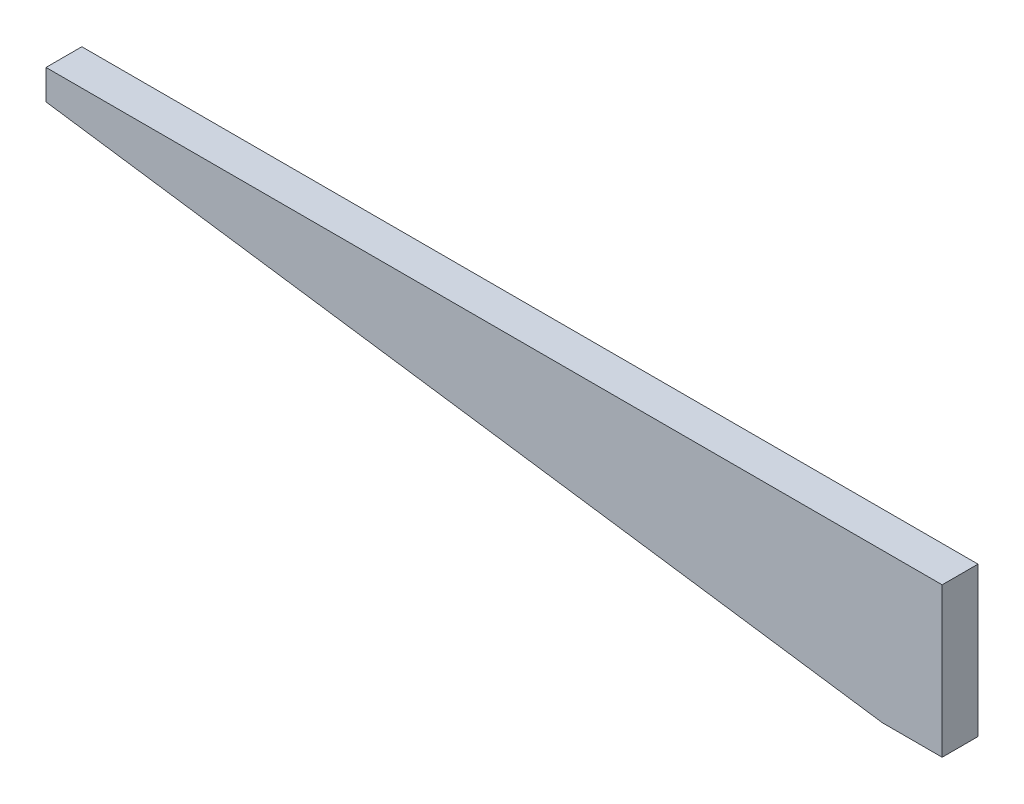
ISO-10303-21;
HEADER;
FILE_DESCRIPTION(('STEP AP214'),'2;1');
FILE_NAME('part.step','',(''),(''),'','','');
FILE_SCHEMA(('AUTOMOTIVE_DESIGN { 1 0 10303 214 1 1 1 1 }'));
ENDSEC;
DATA;
#1=APPLICATION_CONTEXT('core data for automotive mechanical design processes');
#2=APPLICATION_PROTOCOL_DEFINITION('international standard','automotive_design',2000,#1);
#3=PRODUCT_CONTEXT('',#1,'mechanical');
#4=PRODUCT('Part','Part','',(#3));
#5=PRODUCT_RELATED_PRODUCT_CATEGORY('part','',(#4));
#6=PRODUCT_DEFINITION_FORMATION('','',#4);
#7=PRODUCT_DEFINITION_CONTEXT('part definition',#1,'design');
#8=PRODUCT_DEFINITION('design','',#6,#7);
#9=PRODUCT_DEFINITION_SHAPE('','',#8);
#10=(LENGTH_UNIT() NAMED_UNIT(*) SI_UNIT(.MILLI.,.METRE.));
#11=(NAMED_UNIT(*) PLANE_ANGLE_UNIT() SI_UNIT($,.RADIAN.));
#12=(NAMED_UNIT(*) SI_UNIT($,.STERADIAN.) SOLID_ANGLE_UNIT());
#13=UNCERTAINTY_MEASURE_WITH_UNIT(LENGTH_MEASURE(1.E-05),#10,'distance_accuracy_value','');
#14=(GEOMETRIC_REPRESENTATION_CONTEXT(3) GLOBAL_UNCERTAINTY_ASSIGNED_CONTEXT((#13)) GLOBAL_UNIT_ASSIGNED_CONTEXT((#10,
#11,#12)) REPRESENTATION_CONTEXT('',''));
#15=CARTESIAN_POINT('',(0.,0.,0.));
#16=DIRECTION('',(0.,0.,1.));
#17=DIRECTION('',(1.,0.,0.));
#18=AXIS2_PLACEMENT_3D('',#15,#16,#17);
#19=CARTESIAN_POINT('',(-10.,0.,3.));
#20=DIRECTION('',(0.,1.,0.));
#21=DIRECTION('',(0.,0.,1.));
#22=AXIS2_PLACEMENT_3D('',#19,#20,#21);
#23=PLANE('',#22);
#24=DIRECTION('',(1.,0.,0.));
#25=VECTOR('',#24,1.);
#26=CARTESIAN_POINT('',(-10.,0.,-3.));
#27=LINE('',#26,#25);
#28=CARTESIAN_POINT('',(-10.,0.,-3.));
#29=VERTEX_POINT('',#28);
#30=CARTESIAN_POINT('',(0.,0.,-3.));
#31=VERTEX_POINT('',#30);
#32=EDGE_CURVE('E81',#29,#31,#27,.T.);
#33=ORIENTED_EDGE('',*,*,#32,.T.);
#34=DIRECTION('',(0.,0.,-1.));
#35=VECTOR('',#34,1.);
#36=CARTESIAN_POINT('',(0.,0.,3.));
#37=LINE('',#36,#35);
#38=CARTESIAN_POINT('',(0.,0.,3.));
#39=VERTEX_POINT('',#38);
#40=EDGE_CURVE('E11',#39,#31,#37,.T.);
#41=ORIENTED_EDGE('',*,*,#40,.F.);
#42=DIRECTION('',(1.,0.,0.));
#43=VECTOR('',#42,1.);
#44=CARTESIAN_POINT('',(-10.,0.,3.));
#45=LINE('',#44,#43);
#46=CARTESIAN_POINT('',(-10.,0.,3.));
#47=VERTEX_POINT('',#46);
#48=EDGE_CURVE('E102',#47,#39,#45,.T.);
#49=ORIENTED_EDGE('',*,*,#48,.F.);
#50=DIRECTION('',(0.,0.,-1.));
#51=VECTOR('',#50,1.);
#52=CARTESIAN_POINT('',(-10.,0.,3.));
#53=LINE('',#52,#51);
#54=EDGE_CURVE('E94',#47,#29,#53,.T.);
#55=ORIENTED_EDGE('',*,*,#54,.T.);
#56=EDGE_LOOP('',(#33,#41,#49,#55));
#57=FACE_BOUND('',#56,.T.);
#58=ADVANCED_FACE('F31',(#57),#23,.F.);
#59=CARTESIAN_POINT('',(0.,0.,3.));
#60=DIRECTION('',(-1.,0.,0.));
#61=DIRECTION('',(0.,0.,1.));
#62=AXIS2_PLACEMENT_3D('',#59,#60,#61);
#63=PLANE('',#62);
#64=DIRECTION('',(0.,1.,0.));
#65=VECTOR('',#64,1.);
#66=CARTESIAN_POINT('',(0.,0.,-3.));
#67=LINE('',#66,#65);
#68=CARTESIAN_POINT('',(0.,25.,-3.));
#69=VERTEX_POINT('',#68);
#70=EDGE_CURVE('E77',#31,#69,#67,.T.);
#71=ORIENTED_EDGE('',*,*,#70,.T.);
#72=DIRECTION('',(0.,0.,-1.));
#73=VECTOR('',#72,1.);
#74=CARTESIAN_POINT('',(0.,25.,3.));
#75=LINE('',#74,#73);
#76=CARTESIAN_POINT('',(0.,25.,3.));
#77=VERTEX_POINT('',#76);
#78=EDGE_CURVE('E38',#77,#69,#75,.T.);
#79=ORIENTED_EDGE('',*,*,#78,.F.);
#80=DIRECTION('',(0.,1.,0.));
#81=VECTOR('',#80,1.);
#82=CARTESIAN_POINT('',(0.,0.,3.));
#83=LINE('',#82,#81);
#84=EDGE_CURVE('E90',#39,#77,#83,.T.);
#85=ORIENTED_EDGE('',*,*,#84,.F.);
#86=ORIENTED_EDGE('',*,*,#40,.T.);
#87=EDGE_LOOP('',(#71,#79,#85,#86));
#88=FACE_BOUND('',#87,.T.);
#89=ADVANCED_FACE('F89',(#88),#63,.F.);
#90=CARTESIAN_POINT('',(0.,25.,3.));
#91=DIRECTION('',(0.,-1.,0.));
#92=DIRECTION('',(1.,0.,0.));
#93=AXIS2_PLACEMENT_3D('',#90,#91,#92);
#94=PLANE('',#93);
#95=DIRECTION('',(-1.,0.,0.));
#96=VECTOR('',#95,1.);
#97=CARTESIAN_POINT('',(0.,25.,-3.));
#98=LINE('',#97,#96);
#99=CARTESIAN_POINT('',(-150.,25.,-3.));
#100=VERTEX_POINT('',#99);
#101=EDGE_CURVE('E83',#69,#100,#98,.T.);
#102=ORIENTED_EDGE('',*,*,#101,.T.);
#103=DIRECTION('',(0.,0.,-1.));
#104=VECTOR('',#103,1.);
#105=CARTESIAN_POINT('',(-150.,25.,3.));
#106=LINE('',#105,#104);
#107=CARTESIAN_POINT('',(-150.,25.,3.));
#108=VERTEX_POINT('',#107);
#109=EDGE_CURVE('E113',#108,#100,#106,.T.);
#110=ORIENTED_EDGE('',*,*,#109,.F.);
#111=DIRECTION('',(-1.,0.,0.));
#112=VECTOR('',#111,1.);
#113=CARTESIAN_POINT('',(0.,25.,3.));
#114=LINE('',#113,#112);
#115=EDGE_CURVE('E105',#77,#108,#114,.T.);
#116=ORIENTED_EDGE('',*,*,#115,.F.);
#117=ORIENTED_EDGE('',*,*,#78,.T.);
#118=EDGE_LOOP('',(#102,#110,#116,#117));
#119=FACE_BOUND('',#118,.T.);
#120=ADVANCED_FACE('F117',(#119),#94,.F.);
#121=CARTESIAN_POINT('',(-150.,25.,3.));
#122=DIRECTION('',(1.,0.,0.));
#123=DIRECTION('',(0.,0.,-1.));
#124=AXIS2_PLACEMENT_3D('',#121,#122,#123);
#125=PLANE('',#124);
#126=DIRECTION('',(0.,-1.,0.));
#127=VECTOR('',#126,1.);
#128=CARTESIAN_POINT('',(-150.,25.,-3.));
#129=LINE('',#128,#127);
#130=CARTESIAN_POINT('',(-150.,20.,-3.));
#131=VERTEX_POINT('',#130);
#132=EDGE_CURVE('E98',#100,#131,#129,.T.);
#133=ORIENTED_EDGE('',*,*,#132,.T.);
#134=DIRECTION('',(0.,0.,-1.));
#135=VECTOR('',#134,1.);
#136=CARTESIAN_POINT('',(-150.,20.,3.));
#137=LINE('',#136,#135);
#138=CARTESIAN_POINT('',(-150.,20.,3.));
#139=VERTEX_POINT('',#138);
#140=EDGE_CURVE('E110',#139,#131,#137,.T.);
#141=ORIENTED_EDGE('',*,*,#140,.F.);
#142=DIRECTION('',(0.,-1.,0.));
#143=VECTOR('',#142,1.);
#144=CARTESIAN_POINT('',(-150.,25.,3.));
#145=LINE('',#144,#143);
#146=EDGE_CURVE('E50',#108,#139,#145,.T.);
#147=ORIENTED_EDGE('',*,*,#146,.F.);
#148=ORIENTED_EDGE('',*,*,#109,.T.);
#149=EDGE_LOOP('',(#133,#141,#147,#148));
#150=FACE_BOUND('',#149,.T.);
#151=ADVANCED_FACE('F128',(#150),#125,.F.);
#152=CARTESIAN_POINT('',(-150.,20.,3.));
#153=DIRECTION('',(0.141421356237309,0.989949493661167,0.));
#154=DIRECTION('',(-0.989949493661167,0.141421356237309,0.));
#155=AXIS2_PLACEMENT_3D('',#152,#153,#154);
#156=PLANE('',#155);
#157=DIRECTION('',(0.989949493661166,-0.141421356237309,0.));
#158=VECTOR('',#157,1.);
#159=CARTESIAN_POINT('',(-150.,20.,-3.));
#160=LINE('',#159,#158);
#161=EDGE_CURVE('E100',#131,#29,#160,.T.);
#162=ORIENTED_EDGE('',*,*,#161,.T.);
#163=ORIENTED_EDGE('',*,*,#54,.F.);
#164=DIRECTION('',(0.989949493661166,-0.141421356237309,0.));
#165=VECTOR('',#164,1.);
#166=CARTESIAN_POINT('',(-150.,20.,3.));
#167=LINE('',#166,#165);
#168=EDGE_CURVE('E45',#139,#47,#167,.T.);
#169=ORIENTED_EDGE('',*,*,#168,.F.);
#170=ORIENTED_EDGE('',*,*,#140,.T.);
#171=EDGE_LOOP('',(#162,#163,#169,#170));
#172=FACE_BOUND('',#171,.T.);
#173=ADVANCED_FACE('F121',(#172),#156,.F.);
#174=CARTESIAN_POINT('',(0.,0.,3.));
#175=DIRECTION('',(0.,0.,1.));
#176=DIRECTION('',(1.,0.,0.));
#177=AXIS2_PLACEMENT_3D('',#174,#175,#176);
#178=PLANE('',#177);
#179=ORIENTED_EDGE('',*,*,#48,.T.);
#180=ORIENTED_EDGE('',*,*,#84,.T.);
#181=ORIENTED_EDGE('',*,*,#115,.T.);
#182=ORIENTED_EDGE('',*,*,#146,.T.);
#183=ORIENTED_EDGE('',*,*,#168,.T.);
#184=EDGE_LOOP('',(#179,#180,#181,#182,#183));
#185=FACE_BOUND('',#184,.T.);
#186=ADVANCED_FACE('F119',(#185),#178,.T.);
#187=CARTESIAN_POINT('',(0.,0.,-3.));
#188=DIRECTION('',(0.,0.,1.));
#189=DIRECTION('',(1.,0.,0.));
#190=AXIS2_PLACEMENT_3D('',#187,#188,#189);
#191=PLANE('',#190);
#192=ORIENTED_EDGE('',*,*,#32,.F.);
#193=ORIENTED_EDGE('',*,*,#161,.F.);
#194=ORIENTED_EDGE('',*,*,#132,.F.);
#195=ORIENTED_EDGE('',*,*,#101,.F.);
#196=ORIENTED_EDGE('',*,*,#70,.F.);
#197=EDGE_LOOP('',(#192,#193,#194,#195,#196));
#198=FACE_BOUND('',#197,.T.);
#199=ADVANCED_FACE('F78',(#198),#191,.F.);
#200=CLOSED_SHELL('',(#58,#89,#120,#151,#173,#186,#199));
#201=MANIFOLD_SOLID_BREP('B2',#200);
#202=ADVANCED_BREP_SHAPE_REPRESENTATION('',(#18,#201),#14);
#203=SHAPE_DEFINITION_REPRESENTATION(#9,#202);
ENDSEC;
END-ISO-10303-21;
